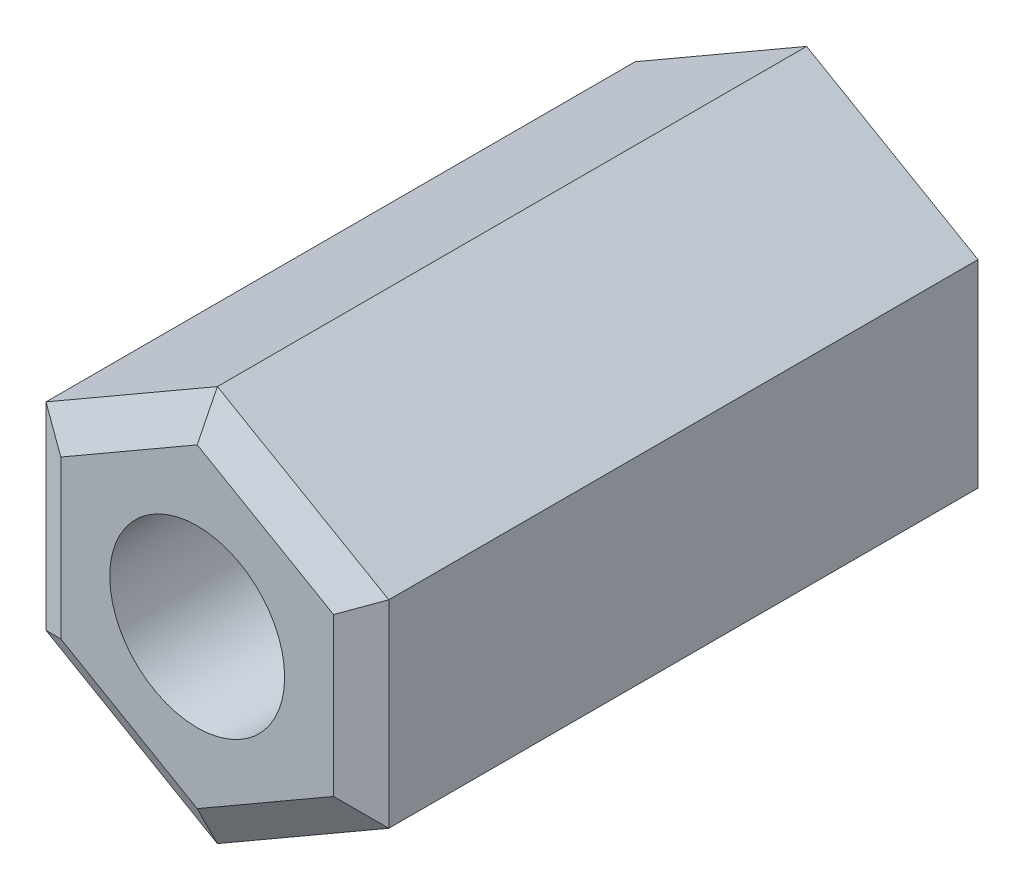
from build123d import *

# Parameters (mm, degrees)
BOSS_EXTRU_1_DEPTH    = 18
TROU_TARAUD_M6X1_01_D = 5
CHANFREIN1_SIZE       = 1
CHANFREIN1_SIZE2      = 0.577350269
CHANFREIN2_SIZE       = 1
CHANFREIN2_SIZE2      = 0.577350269


with BuildPart() as part:
    # Esquisse1 → Boss.-Extru.1 (new body)
    with BuildSketch(Plane.XY):
        Polygon((4.9, -2.829016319), (4.9, 2.829016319), (0, 5.658032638), (-4.9, 2.829016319), (-4.9, -2.829016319), (0, -5.658032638), align=None)
    extrude(amount=BOSS_EXTRU_1_DEPTH)

    # Trou taraud_ M6x1.01 (through all)
    with Locations(Plane.XY.offset(18)):
        with Locations((0, 0)):
            Hole(TROU_TARAUD_M6X1_01_D / 2)

    # Chanfrein1
    chanfrein1_edges = [part.edges().sort_by_distance(p)[0] for p in [
        (2.45, 4.243524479, 18),
        (-2.45, 4.243524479, 18),
        (-4.9, 0, 18),
        (-2.45, -4.243524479, 18),
        (2.45, -4.243524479, 18),
        (4.9, 0, 18),
    ]]
    chanfrein1_side = [part.faces().sort_by_distance(p)[0] for p in [
        (4.750302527, 0, 18),
    ]]
    chamfer(chanfrein1_edges, length=CHANFREIN1_SIZE, length2=CHANFREIN1_SIZE2, reference=chanfrein1_side[0])

    # Chanfrein2
    chanfrein2_edges = [part.edges().sort_by_distance(p)[0] for p in [
        (-2.45, -4.243524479, 0),
        (-4.9, 0, 0),
        (-2.45, 4.243524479, 0),
        (2.45, 4.243524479, 0),
        (4.9, 0, 0),
        (2.45, -4.243524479, 0),
    ]]
    chanfrein2_side = [part.faces().sort_by_distance(p)[0] for p in [
        (4.750302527, 0, 0),
    ]]
    chamfer(chanfrein2_edges, length=CHANFREIN2_SIZE, length2=CHANFREIN2_SIZE2, reference=chanfrein2_side[0])


solid = part.part
